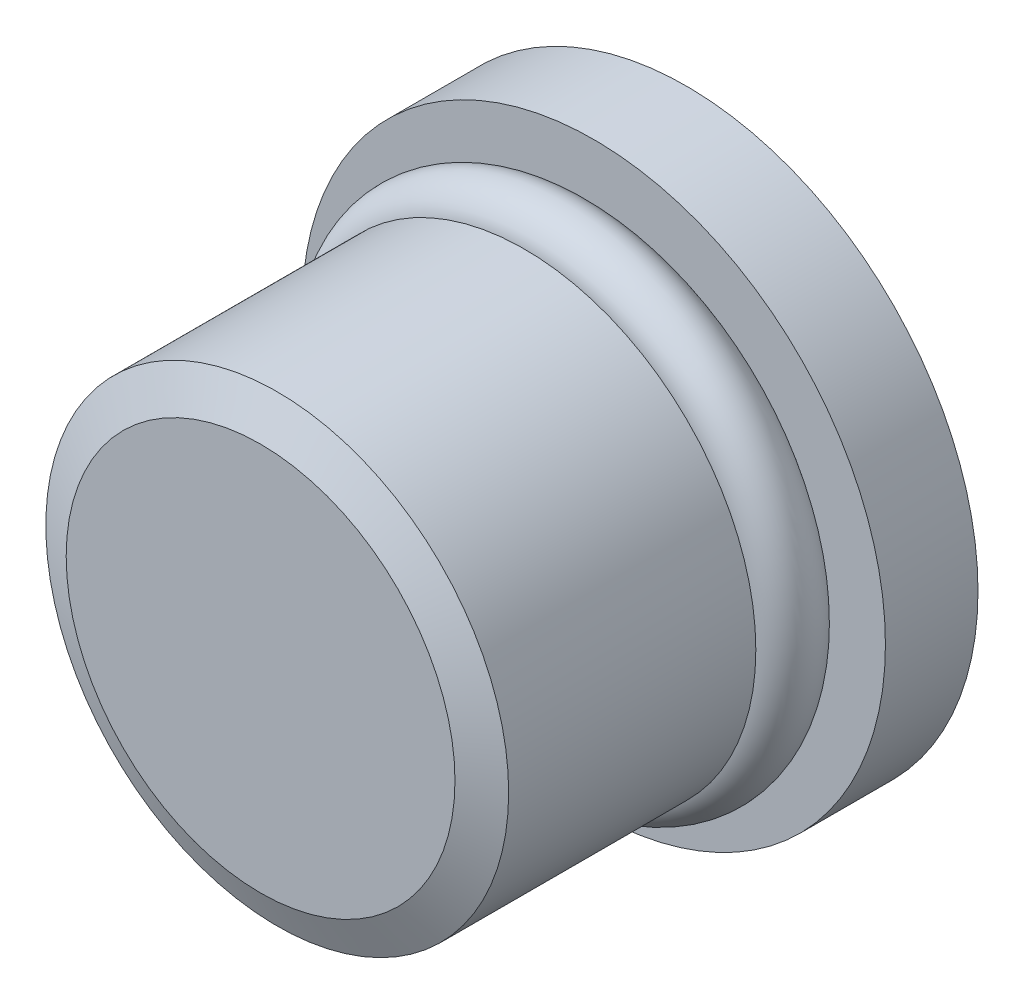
from build123d import *

# Parameters (mm, degrees)
SKETCH3_R          = 0.889
CUT_EXTRUDE1_DEPTH = 4.6736


with BuildPart() as part:
    # Sketch1 → Revolve1 (revolve)
    with BuildSketch(Plane(origin=(0, 0, 0), x_dir=(0, 0, -1), z_dir=(1, 0, 0)), mode=Mode.PRIVATE) as revolve1_sk:
        Polygon((-11.684, 5.334), (-11.2268, 6.35), (-4.445, 6.35), (-4.445, 5.4102), (-2.54, 5.4102), (-2.54, 8.001), (0, 8.001), (0, 0), (-11.684, 0), align=None)
    revolve(revolve1_sk.sketch.rotate(Axis((0, 0, 12.2682), (0, 0, -1)), 90), axis=Axis((0, 0, 12.2682), (0, 0, -1)))

    # Sketch4 → Cut-Extrude1 (cut)
    with BuildSketch(Plane(origin=(0, 0, 0), x_dir=(-1, 0, 0), z_dir=(0, 0, -1))):
        Polygon((-2.38125, -1.374815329), (-2.38125, 1.374815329), (0, 2.749630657), (2.38125, 1.374815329), (2.38125, -1.374815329), (0, -2.749630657), align=None)
    extrude(amount=-CUT_EXTRUDE1_DEPTH, mode=Mode.SUBTRACT)


with BuildPart() as body_2:
    # Sketch3 → Revolve3 (revolve)
    with BuildSketch(Plane(origin=(0, 0, 0), x_dir=(0, 0, -1), z_dir=(1, 0, 0)), mode=Mode.PRIVATE) as revolve3_sk:
        with Locations((-3.429, 6.096)):
            Circle(SKETCH3_R)
    revolve(revolve3_sk.sketch.rotate(Axis((0, 0, 4.4069), (0, 0, -1)), 90), axis=Axis((0, 0, 4.4069), (0, 0, -1)))


solid = Compound([part.part, body_2.part])
